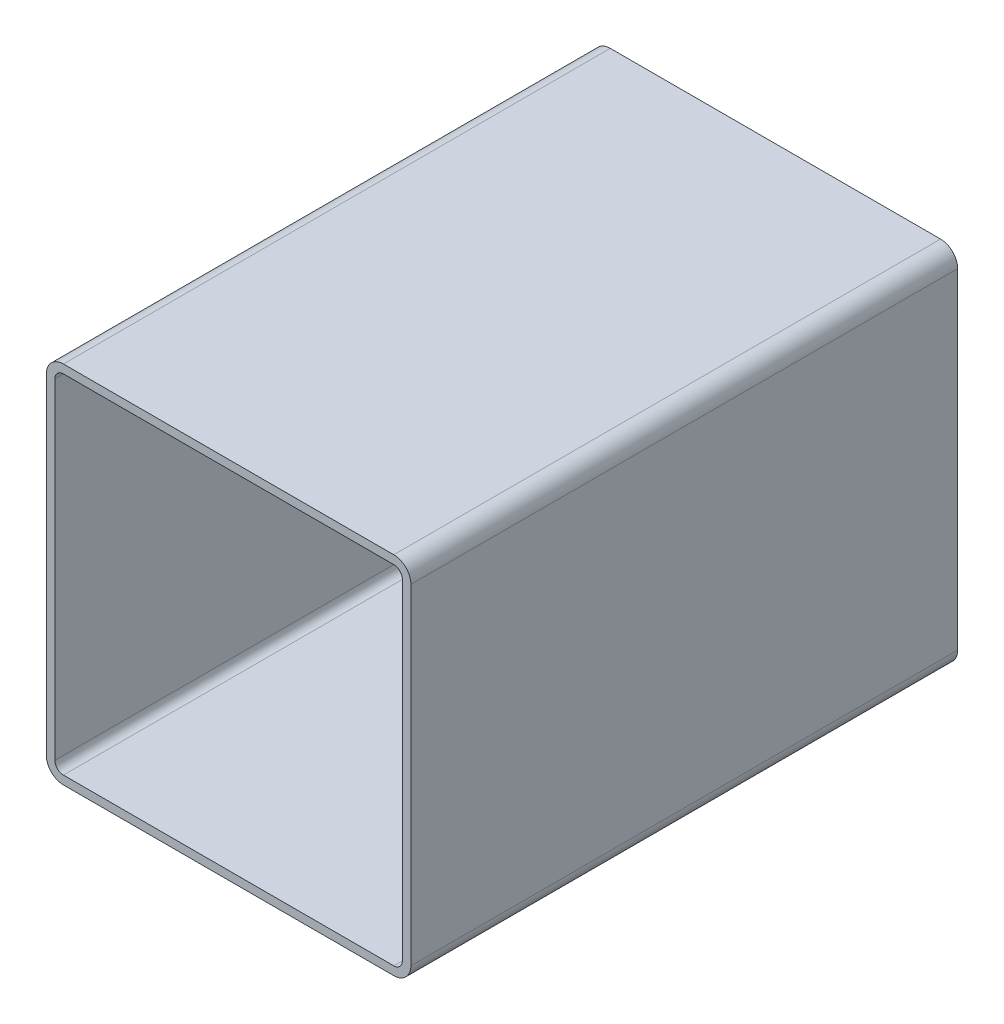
ISO-10303-21;
HEADER;
FILE_DESCRIPTION(('STEP AP214'),'2;1');
FILE_NAME('part.step','',(''),(''),'','','');
FILE_SCHEMA(('AUTOMOTIVE_DESIGN { 1 0 10303 214 1 1 1 1 }'));
ENDSEC;
DATA;
#1=APPLICATION_CONTEXT('core data for automotive mechanical design processes');
#2=APPLICATION_PROTOCOL_DEFINITION('international standard','automotive_design',2000,#1);
#3=PRODUCT_CONTEXT('',#1,'mechanical');
#4=PRODUCT('Part','Part','',(#3));
#5=PRODUCT_RELATED_PRODUCT_CATEGORY('part','',(#4));
#6=PRODUCT_DEFINITION_FORMATION('','',#4);
#7=PRODUCT_DEFINITION_CONTEXT('part definition',#1,'design');
#8=PRODUCT_DEFINITION('design','',#6,#7);
#9=PRODUCT_DEFINITION_SHAPE('','',#8);
#10=(LENGTH_UNIT() NAMED_UNIT(*) SI_UNIT(.MILLI.,.METRE.));
#11=(NAMED_UNIT(*) PLANE_ANGLE_UNIT() SI_UNIT($,.RADIAN.));
#12=(NAMED_UNIT(*) SI_UNIT($,.STERADIAN.) SOLID_ANGLE_UNIT());
#13=UNCERTAINTY_MEASURE_WITH_UNIT(LENGTH_MEASURE(1.E-05),#10,'distance_accuracy_value','');
#14=(GEOMETRIC_REPRESENTATION_CONTEXT(3) GLOBAL_UNCERTAINTY_ASSIGNED_CONTEXT((#13)) GLOBAL_UNIT_ASSIGNED_CONTEXT((#10,
#11,#12)) REPRESENTATION_CONTEXT('',''));
#15=CARTESIAN_POINT('',(0.,0.,0.));
#16=DIRECTION('',(0.,0.,1.));
#17=DIRECTION('',(1.,0.,0.));
#18=AXIS2_PLACEMENT_3D('',#15,#16,#17);
#19=CARTESIAN_POINT('',(10.9159404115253,195.641130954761,304.8));
#20=DIRECTION('',(0.,0.,1.));
#21=DIRECTION('',(1.,0.,0.));
#22=AXIS2_PLACEMENT_3D('',#19,#20,#21);
#23=PLANE('',#22);
#24=CARTESIAN_POINT('',(10.9159404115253,195.641130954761,304.8));
#25=DIRECTION('',(0.,0.,1.));
#26=DIRECTION('',(1.,0.,0.));
#27=AXIS2_PLACEMENT_3D('',#24,#25,#26);
#28=CIRCLE('',#27,9.52500000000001);
#29=CARTESIAN_POINT('',(10.9159404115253,205.166130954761,304.8));
#30=VERTEX_POINT('',#29);
#31=CARTESIAN_POINT('',(1.3909404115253,195.641130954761,304.8));
#32=VERTEX_POINT('',#31);
#33=EDGE_CURVE('E211',#30,#32,#28,.T.);
#34=ORIENTED_EDGE('',*,*,#33,.T.);
#35=DIRECTION('',(0.,-1.,0.));
#36=VECTOR('',#35,1.);
#37=CARTESIAN_POINT('',(1.3909404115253,11.4911309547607,304.8));
#38=LINE('',#37,#36);
#39=CARTESIAN_POINT('',(1.3909404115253,11.4911309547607,304.8));
#40=VERTEX_POINT('',#39);
#41=EDGE_CURVE('E214',#32,#40,#38,.T.);
#42=ORIENTED_EDGE('',*,*,#41,.T.);
#43=CARTESIAN_POINT('',(10.9159404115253,11.4911309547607,304.8));
#44=DIRECTION('',(0.,0.,1.));
#45=DIRECTION('',(1.,0.,0.));
#46=AXIS2_PLACEMENT_3D('',#43,#44,#45);
#47=CIRCLE('',#46,9.525);
#48=CARTESIAN_POINT('',(10.9159404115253,1.96613095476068,304.8));
#49=VERTEX_POINT('',#48);
#50=EDGE_CURVE('E217',#40,#49,#47,.T.);
#51=ORIENTED_EDGE('',*,*,#50,.T.);
#52=DIRECTION('',(1.,0.,0.));
#53=VECTOR('',#52,1.);
#54=CARTESIAN_POINT('',(195.065940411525,1.96613095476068,304.8));
#55=LINE('',#54,#53);
#56=CARTESIAN_POINT('',(195.065940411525,1.96613095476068,304.8));
#57=VERTEX_POINT('',#56);
#58=EDGE_CURVE('E219',#49,#57,#55,.T.);
#59=ORIENTED_EDGE('',*,*,#58,.T.);
#60=CARTESIAN_POINT('',(195.065940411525,11.4911309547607,304.8));
#61=DIRECTION('',(0.,0.,1.));
#62=DIRECTION('',(1.,0.,0.));
#63=AXIS2_PLACEMENT_3D('',#60,#61,#62);
#64=CIRCLE('',#63,9.525);
#65=CARTESIAN_POINT('',(204.590940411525,11.4911309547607,304.8));
#66=VERTEX_POINT('',#65);
#67=EDGE_CURVE('E221',#57,#66,#64,.T.);
#68=ORIENTED_EDGE('',*,*,#67,.T.);
#69=DIRECTION('',(0.,1.,0.));
#70=VECTOR('',#69,1.);
#71=CARTESIAN_POINT('',(204.590940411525,195.641130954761,304.8));
#72=LINE('',#71,#70);
#73=CARTESIAN_POINT('',(204.590940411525,195.641130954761,304.8));
#74=VERTEX_POINT('',#73);
#75=EDGE_CURVE('E223',#66,#74,#72,.T.);
#76=ORIENTED_EDGE('',*,*,#75,.T.);
#77=CARTESIAN_POINT('',(195.065940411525,195.641130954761,304.8));
#78=DIRECTION('',(0.,0.,1.));
#79=DIRECTION('',(1.,0.,0.));
#80=AXIS2_PLACEMENT_3D('',#77,#78,#79);
#81=CIRCLE('',#80,9.52500000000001);
#82=CARTESIAN_POINT('',(195.065940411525,205.166130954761,304.8));
#83=VERTEX_POINT('',#82);
#84=EDGE_CURVE('E225',#74,#83,#81,.T.);
#85=ORIENTED_EDGE('',*,*,#84,.T.);
#86=DIRECTION('',(-1.,0.,0.));
#87=VECTOR('',#86,1.);
#88=CARTESIAN_POINT('',(10.9159404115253,205.166130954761,304.8));
#89=LINE('',#88,#87);
#90=EDGE_CURVE('E227',#83,#30,#89,.T.);
#91=ORIENTED_EDGE('',*,*,#90,.T.);
#92=EDGE_LOOP('',(#34,#42,#51,#59,#68,#76,#85,#91));
#93=FACE_BOUND('',#92,.T.);
#94=DIRECTION('',(0.,-1.,0.));
#95=VECTOR('',#94,1.);
#96=CARTESIAN_POINT('',(6.1534404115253,11.4911309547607,304.8));
#97=LINE('',#96,#95);
#98=CARTESIAN_POINT('',(6.1534404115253,195.641130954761,304.8));
#99=VERTEX_POINT('',#98);
#100=CARTESIAN_POINT('',(6.1534404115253,11.4911309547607,304.8));
#101=VERTEX_POINT('',#100);
#102=EDGE_CURVE('E154',#99,#101,#97,.T.);
#103=ORIENTED_EDGE('',*,*,#102,.F.);
#104=CARTESIAN_POINT('',(10.9159404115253,195.641130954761,304.8));
#105=DIRECTION('',(0.,0.,1.));
#106=DIRECTION('',(1.,0.,0.));
#107=AXIS2_PLACEMENT_3D('',#104,#105,#106);
#108=CIRCLE('',#107,4.7625);
#109=CARTESIAN_POINT('',(10.9159404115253,200.403630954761,304.8));
#110=VERTEX_POINT('',#109);
#111=EDGE_CURVE('E146',#110,#99,#108,.T.);
#112=ORIENTED_EDGE('',*,*,#111,.F.);
#113=DIRECTION('',(-1.,0.,0.));
#114=VECTOR('',#113,1.);
#115=CARTESIAN_POINT('',(10.9159404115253,200.403630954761,304.8));
#116=LINE('',#115,#114);
#117=CARTESIAN_POINT('',(195.065940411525,200.403630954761,304.8));
#118=VERTEX_POINT('',#117);
#119=EDGE_CURVE('E179',#118,#110,#116,.T.);
#120=ORIENTED_EDGE('',*,*,#119,.F.);
#121=CARTESIAN_POINT('',(195.065940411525,195.641130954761,304.8));
#122=DIRECTION('',(0.,0.,1.));
#123=DIRECTION('',(1.,0.,0.));
#124=AXIS2_PLACEMENT_3D('',#121,#122,#123);
#125=CIRCLE('',#124,4.7625);
#126=CARTESIAN_POINT('',(199.828440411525,195.641130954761,304.8));
#127=VERTEX_POINT('',#126);
#128=EDGE_CURVE('E177',#127,#118,#125,.T.);
#129=ORIENTED_EDGE('',*,*,#128,.F.);
#130=DIRECTION('',(0.,1.,0.));
#131=VECTOR('',#130,1.);
#132=CARTESIAN_POINT('',(199.828440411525,195.641130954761,304.8));
#133=LINE('',#132,#131);
#134=CARTESIAN_POINT('',(199.828440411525,11.4911309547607,304.8));
#135=VERTEX_POINT('',#134);
#136=EDGE_CURVE('E175',#135,#127,#133,.T.);
#137=ORIENTED_EDGE('',*,*,#136,.F.);
#138=CARTESIAN_POINT('',(195.065940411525,11.4911309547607,304.8));
#139=DIRECTION('',(0.,0.,1.));
#140=DIRECTION('',(1.,0.,0.));
#141=AXIS2_PLACEMENT_3D('',#138,#139,#140);
#142=CIRCLE('',#141,4.7625);
#143=CARTESIAN_POINT('',(195.065940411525,6.72863095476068,304.8));
#144=VERTEX_POINT('',#143);
#145=EDGE_CURVE('E173',#144,#135,#142,.T.);
#146=ORIENTED_EDGE('',*,*,#145,.F.);
#147=DIRECTION('',(1.,0.,0.));
#148=VECTOR('',#147,1.);
#149=CARTESIAN_POINT('',(195.065940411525,6.72863095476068,304.8));
#150=LINE('',#149,#148);
#151=CARTESIAN_POINT('',(10.9159404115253,6.72863095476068,304.8));
#152=VERTEX_POINT('',#151);
#153=EDGE_CURVE('E169',#152,#144,#150,.T.);
#154=ORIENTED_EDGE('',*,*,#153,.F.);
#155=CARTESIAN_POINT('',(10.9159404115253,11.4911309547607,304.8));
#156=DIRECTION('',(0.,0.,1.));
#157=DIRECTION('',(1.,0.,0.));
#158=AXIS2_PLACEMENT_3D('',#155,#156,#157);
#159=CIRCLE('',#158,4.7625);
#160=EDGE_CURVE('E167',#101,#152,#159,.T.);
#161=ORIENTED_EDGE('',*,*,#160,.F.);
#162=EDGE_LOOP('',(#103,#112,#120,#129,#137,#146,#154,#161));
#163=FACE_BOUND('',#162,.T.);
#164=ADVANCED_FACE('F33',(#93,#163),#23,.T.);
#165=CARTESIAN_POINT('',(10.9159404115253,195.641130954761,0.));
#166=DIRECTION('',(0.,0.,1.));
#167=DIRECTION('',(1.,0.,0.));
#168=AXIS2_PLACEMENT_3D('',#165,#166,#167);
#169=PLANE('',#168);
#170=CARTESIAN_POINT('',(10.9159404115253,195.641130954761,0.));
#171=DIRECTION('',(0.,0.,1.));
#172=DIRECTION('',(1.,0.,0.));
#173=AXIS2_PLACEMENT_3D('',#170,#171,#172);
#174=CIRCLE('',#173,9.52500000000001);
#175=CARTESIAN_POINT('',(10.9159404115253,205.166130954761,0.));
#176=VERTEX_POINT('',#175);
#177=CARTESIAN_POINT('',(1.3909404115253,195.641130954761,0.));
#178=VERTEX_POINT('',#177);
#179=EDGE_CURVE('E162',#176,#178,#174,.T.);
#180=ORIENTED_EDGE('',*,*,#179,.F.);
#181=DIRECTION('',(-1.,0.,0.));
#182=VECTOR('',#181,1.);
#183=CARTESIAN_POINT('',(10.9159404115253,205.166130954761,0.));
#184=LINE('',#183,#182);
#185=CARTESIAN_POINT('',(195.065940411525,205.166130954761,0.));
#186=VERTEX_POINT('',#185);
#187=EDGE_CURVE('E215',#186,#176,#184,.T.);
#188=ORIENTED_EDGE('',*,*,#187,.F.);
#189=CARTESIAN_POINT('',(195.065940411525,195.641130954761,0.));
#190=DIRECTION('',(0.,0.,1.));
#191=DIRECTION('',(1.,0.,0.));
#192=AXIS2_PLACEMENT_3D('',#189,#190,#191);
#193=CIRCLE('',#192,9.52500000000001);
#194=CARTESIAN_POINT('',(204.590940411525,195.641130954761,0.));
#195=VERTEX_POINT('',#194);
#196=EDGE_CURVE('E242',#195,#186,#193,.T.);
#197=ORIENTED_EDGE('',*,*,#196,.F.);
#198=DIRECTION('',(0.,1.,0.));
#199=VECTOR('',#198,1.);
#200=CARTESIAN_POINT('',(204.590940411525,195.641130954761,0.));
#201=LINE('',#200,#199);
#202=CARTESIAN_POINT('',(204.590940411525,11.4911309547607,0.));
#203=VERTEX_POINT('',#202);
#204=EDGE_CURVE('E240',#203,#195,#201,.T.);
#205=ORIENTED_EDGE('',*,*,#204,.F.);
#206=CARTESIAN_POINT('',(195.065940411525,11.4911309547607,0.));
#207=DIRECTION('',(0.,0.,1.));
#208=DIRECTION('',(1.,0.,0.));
#209=AXIS2_PLACEMENT_3D('',#206,#207,#208);
#210=CIRCLE('',#209,9.525);
#211=CARTESIAN_POINT('',(195.065940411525,1.96613095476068,0.));
#212=VERTEX_POINT('',#211);
#213=EDGE_CURVE('E238',#212,#203,#210,.T.);
#214=ORIENTED_EDGE('',*,*,#213,.F.);
#215=DIRECTION('',(1.,0.,0.));
#216=VECTOR('',#215,1.);
#217=CARTESIAN_POINT('',(195.065940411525,1.96613095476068,0.));
#218=LINE('',#217,#216);
#219=CARTESIAN_POINT('',(10.9159404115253,1.96613095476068,0.));
#220=VERTEX_POINT('',#219);
#221=EDGE_CURVE('E236',#220,#212,#218,.T.);
#222=ORIENTED_EDGE('',*,*,#221,.F.);
#223=CARTESIAN_POINT('',(10.9159404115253,11.4911309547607,0.));
#224=DIRECTION('',(0.,0.,1.));
#225=DIRECTION('',(1.,0.,0.));
#226=AXIS2_PLACEMENT_3D('',#223,#224,#225);
#227=CIRCLE('',#226,9.525);
#228=CARTESIAN_POINT('',(1.3909404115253,11.4911309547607,0.));
#229=VERTEX_POINT('',#228);
#230=EDGE_CURVE('E234',#229,#220,#227,.T.);
#231=ORIENTED_EDGE('',*,*,#230,.F.);
#232=DIRECTION('',(0.,-1.,0.));
#233=VECTOR('',#232,1.);
#234=CARTESIAN_POINT('',(1.3909404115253,11.4911309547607,0.));
#235=LINE('',#234,#233);
#236=EDGE_CURVE('E232',#178,#229,#235,.T.);
#237=ORIENTED_EDGE('',*,*,#236,.F.);
#238=EDGE_LOOP('',(#180,#188,#197,#205,#214,#222,#231,#237));
#239=FACE_BOUND('',#238,.T.);
#240=CARTESIAN_POINT('',(10.9159404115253,195.641130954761,0.));
#241=DIRECTION('',(0.,0.,1.));
#242=DIRECTION('',(1.,0.,0.));
#243=AXIS2_PLACEMENT_3D('',#240,#241,#242);
#244=CIRCLE('',#243,4.7625);
#245=CARTESIAN_POINT('',(10.9159404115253,200.403630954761,0.));
#246=VERTEX_POINT('',#245);
#247=CARTESIAN_POINT('',(6.1534404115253,195.641130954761,0.));
#248=VERTEX_POINT('',#247);
#249=EDGE_CURVE('E56',#246,#248,#244,.T.);
#250=ORIENTED_EDGE('',*,*,#249,.T.);
#251=DIRECTION('',(0.,-1.,0.));
#252=VECTOR('',#251,1.);
#253=CARTESIAN_POINT('',(6.1534404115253,11.4911309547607,0.));
#254=LINE('',#253,#252);
#255=CARTESIAN_POINT('',(6.1534404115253,11.4911309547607,0.));
#256=VERTEX_POINT('',#255);
#257=EDGE_CURVE('E161',#248,#256,#254,.T.);
#258=ORIENTED_EDGE('',*,*,#257,.T.);
#259=CARTESIAN_POINT('',(10.9159404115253,11.4911309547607,0.));
#260=DIRECTION('',(0.,0.,1.));
#261=DIRECTION('',(1.,0.,0.));
#262=AXIS2_PLACEMENT_3D('',#259,#260,#261);
#263=CIRCLE('',#262,4.7625);
#264=CARTESIAN_POINT('',(10.9159404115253,6.72863095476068,0.));
#265=VERTEX_POINT('',#264);
#266=EDGE_CURVE('E183',#256,#265,#263,.T.);
#267=ORIENTED_EDGE('',*,*,#266,.T.);
#268=DIRECTION('',(1.,0.,0.));
#269=VECTOR('',#268,1.);
#270=CARTESIAN_POINT('',(195.065940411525,6.72863095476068,0.));
#271=LINE('',#270,#269);
#272=CARTESIAN_POINT('',(195.065940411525,6.72863095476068,0.));
#273=VERTEX_POINT('',#272);
#274=EDGE_CURVE('E186',#265,#273,#271,.T.);
#275=ORIENTED_EDGE('',*,*,#274,.T.);
#276=CARTESIAN_POINT('',(195.065940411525,11.4911309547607,0.));
#277=DIRECTION('',(0.,0.,1.));
#278=DIRECTION('',(1.,0.,0.));
#279=AXIS2_PLACEMENT_3D('',#276,#277,#278);
#280=CIRCLE('',#279,4.7625);
#281=CARTESIAN_POINT('',(199.828440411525,11.4911309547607,0.));
#282=VERTEX_POINT('',#281);
#283=EDGE_CURVE('E189',#273,#282,#280,.T.);
#284=ORIENTED_EDGE('',*,*,#283,.T.);
#285=DIRECTION('',(0.,1.,0.));
#286=VECTOR('',#285,1.);
#287=CARTESIAN_POINT('',(199.828440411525,195.641130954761,0.));
#288=LINE('',#287,#286);
#289=CARTESIAN_POINT('',(199.828440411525,195.641130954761,0.));
#290=VERTEX_POINT('',#289);
#291=EDGE_CURVE('E192',#282,#290,#288,.T.);
#292=ORIENTED_EDGE('',*,*,#291,.T.);
#293=CARTESIAN_POINT('',(195.065940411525,195.641130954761,0.));
#294=DIRECTION('',(0.,0.,1.));
#295=DIRECTION('',(1.,0.,0.));
#296=AXIS2_PLACEMENT_3D('',#293,#294,#295);
#297=CIRCLE('',#296,4.7625);
#298=CARTESIAN_POINT('',(195.065940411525,200.403630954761,0.));
#299=VERTEX_POINT('',#298);
#300=EDGE_CURVE('E195',#290,#299,#297,.T.);
#301=ORIENTED_EDGE('',*,*,#300,.T.);
#302=DIRECTION('',(-1.,0.,0.));
#303=VECTOR('',#302,1.);
#304=CARTESIAN_POINT('',(10.9159404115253,200.403630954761,0.));
#305=LINE('',#304,#303);
#306=EDGE_CURVE('E155',#299,#246,#305,.T.);
#307=ORIENTED_EDGE('',*,*,#306,.T.);
#308=EDGE_LOOP('',(#250,#258,#267,#275,#284,#292,#301,#307));
#309=FACE_BOUND('',#308,.T.);
#310=ADVANCED_FACE('F272',(#239,#309),#169,.F.);
#311=CARTESIAN_POINT('',(10.9159404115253,195.641130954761,304.8));
#312=DIRECTION('',(0.,0.,-1.));
#313=DIRECTION('',(-1.,0.,0.));
#314=AXIS2_PLACEMENT_3D('',#311,#312,#313);
#315=CYLINDRICAL_SURFACE('',#314,9.52500000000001);
#316=ORIENTED_EDGE('',*,*,#179,.T.);
#317=DIRECTION('',(0.,0.,-1.));
#318=VECTOR('',#317,1.);
#319=CARTESIAN_POINT('',(1.3909404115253,195.641130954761,304.8));
#320=LINE('',#319,#318);
#321=EDGE_CURVE('E11',#32,#178,#320,.T.);
#322=ORIENTED_EDGE('',*,*,#321,.F.);
#323=ORIENTED_EDGE('',*,*,#33,.F.);
#324=DIRECTION('',(0.,0.,-1.));
#325=VECTOR('',#324,1.);
#326=CARTESIAN_POINT('',(10.9159404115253,205.166130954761,304.8));
#327=LINE('',#326,#325);
#328=EDGE_CURVE('E229',#30,#176,#327,.T.);
#329=ORIENTED_EDGE('',*,*,#328,.T.);
#330=EDGE_LOOP('',(#316,#322,#323,#329));
#331=FACE_BOUND('',#330,.T.);
#332=ADVANCED_FACE('F35',(#331),#315,.T.);
#333=CARTESIAN_POINT('',(1.3909404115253,11.4911309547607,304.8));
#334=DIRECTION('',(1.,0.,0.));
#335=DIRECTION('',(0.,0.,-1.));
#336=AXIS2_PLACEMENT_3D('',#333,#334,#335);
#337=PLANE('',#336);
#338=ORIENTED_EDGE('',*,*,#236,.T.);
#339=DIRECTION('',(0.,0.,-1.));
#340=VECTOR('',#339,1.);
#341=CARTESIAN_POINT('',(1.3909404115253,11.4911309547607,304.8));
#342=LINE('',#341,#340);
#343=EDGE_CURVE('E41',#40,#229,#342,.T.);
#344=ORIENTED_EDGE('',*,*,#343,.F.);
#345=ORIENTED_EDGE('',*,*,#41,.F.);
#346=ORIENTED_EDGE('',*,*,#321,.T.);
#347=EDGE_LOOP('',(#338,#344,#345,#346));
#348=FACE_BOUND('',#347,.T.);
#349=ADVANCED_FACE('F289',(#348),#337,.F.);
#350=CARTESIAN_POINT('',(10.9159404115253,11.4911309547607,304.8));
#351=DIRECTION('',(0.,0.,-1.));
#352=DIRECTION('',(-1.,0.,0.));
#353=AXIS2_PLACEMENT_3D('',#350,#351,#352);
#354=CYLINDRICAL_SURFACE('',#353,9.525);
#355=ORIENTED_EDGE('',*,*,#230,.T.);
#356=DIRECTION('',(0.,0.,-1.));
#357=VECTOR('',#356,1.);
#358=CARTESIAN_POINT('',(10.9159404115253,1.96613095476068,304.8));
#359=LINE('',#358,#357);
#360=EDGE_CURVE('E259',#49,#220,#359,.T.);
#361=ORIENTED_EDGE('',*,*,#360,.F.);
#362=ORIENTED_EDGE('',*,*,#50,.F.);
#363=ORIENTED_EDGE('',*,*,#343,.T.);
#364=EDGE_LOOP('',(#355,#361,#362,#363));
#365=FACE_BOUND('',#364,.T.);
#366=ADVANCED_FACE('F266',(#365),#354,.T.);
#367=CARTESIAN_POINT('',(195.065940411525,1.96613095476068,304.8));
#368=DIRECTION('',(0.,1.,0.));
#369=DIRECTION('',(0.,0.,1.));
#370=AXIS2_PLACEMENT_3D('',#367,#368,#369);
#371=PLANE('',#370);
#372=ORIENTED_EDGE('',*,*,#221,.T.);
#373=DIRECTION('',(0.,0.,-1.));
#374=VECTOR('',#373,1.);
#375=CARTESIAN_POINT('',(195.065940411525,1.96613095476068,304.8));
#376=LINE('',#375,#374);
#377=EDGE_CURVE('E256',#57,#212,#376,.T.);
#378=ORIENTED_EDGE('',*,*,#377,.F.);
#379=ORIENTED_EDGE('',*,*,#58,.F.);
#380=ORIENTED_EDGE('',*,*,#360,.T.);
#381=EDGE_LOOP('',(#372,#378,#379,#380));
#382=FACE_BOUND('',#381,.T.);
#383=ADVANCED_FACE('F278',(#382),#371,.F.);
#384=CARTESIAN_POINT('',(195.065940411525,11.4911309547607,304.8));
#385=DIRECTION('',(0.,0.,-1.));
#386=DIRECTION('',(-1.,0.,0.));
#387=AXIS2_PLACEMENT_3D('',#384,#385,#386);
#388=CYLINDRICAL_SURFACE('',#387,9.525);
#389=ORIENTED_EDGE('',*,*,#213,.T.);
#390=DIRECTION('',(0.,0.,-1.));
#391=VECTOR('',#390,1.);
#392=CARTESIAN_POINT('',(204.590940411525,11.4911309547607,304.8));
#393=LINE('',#392,#391);
#394=EDGE_CURVE('E253',#66,#203,#393,.T.);
#395=ORIENTED_EDGE('',*,*,#394,.F.);
#396=ORIENTED_EDGE('',*,*,#67,.F.);
#397=ORIENTED_EDGE('',*,*,#377,.T.);
#398=EDGE_LOOP('',(#389,#395,#396,#397));
#399=FACE_BOUND('',#398,.T.);
#400=ADVANCED_FACE('F282',(#399),#388,.T.);
#401=CARTESIAN_POINT('',(204.590940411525,195.641130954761,304.8));
#402=DIRECTION('',(-1.,0.,0.));
#403=DIRECTION('',(0.,0.,1.));
#404=AXIS2_PLACEMENT_3D('',#401,#402,#403);
#405=PLANE('',#404);
#406=ORIENTED_EDGE('',*,*,#204,.T.);
#407=DIRECTION('',(0.,0.,-1.));
#408=VECTOR('',#407,1.);
#409=CARTESIAN_POINT('',(204.590940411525,195.641130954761,304.8));
#410=LINE('',#409,#408);
#411=EDGE_CURVE('E250',#74,#195,#410,.T.);
#412=ORIENTED_EDGE('',*,*,#411,.F.);
#413=ORIENTED_EDGE('',*,*,#75,.F.);
#414=ORIENTED_EDGE('',*,*,#394,.T.);
#415=EDGE_LOOP('',(#406,#412,#413,#414));
#416=FACE_BOUND('',#415,.T.);
#417=ADVANCED_FACE('F302',(#416),#405,.F.);
#418=CARTESIAN_POINT('',(195.065940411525,195.641130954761,304.8));
#419=DIRECTION('',(0.,0.,-1.));
#420=DIRECTION('',(-1.,0.,0.));
#421=AXIS2_PLACEMENT_3D('',#418,#419,#420);
#422=CYLINDRICAL_SURFACE('',#421,9.52500000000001);
#423=ORIENTED_EDGE('',*,*,#196,.T.);
#424=DIRECTION('',(0.,0.,-1.));
#425=VECTOR('',#424,1.);
#426=CARTESIAN_POINT('',(195.065940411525,205.166130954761,304.8));
#427=LINE('',#426,#425);
#428=EDGE_CURVE('E247',#83,#186,#427,.T.);
#429=ORIENTED_EDGE('',*,*,#428,.F.);
#430=ORIENTED_EDGE('',*,*,#84,.F.);
#431=ORIENTED_EDGE('',*,*,#411,.T.);
#432=EDGE_LOOP('',(#423,#429,#430,#431));
#433=FACE_BOUND('',#432,.T.);
#434=ADVANCED_FACE('F300',(#433),#422,.T.);
#435=CARTESIAN_POINT('',(10.9159404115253,205.166130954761,304.8));
#436=DIRECTION('',(0.,-1.,0.));
#437=DIRECTION('',(0.,0.,-1.));
#438=AXIS2_PLACEMENT_3D('',#435,#436,#437);
#439=PLANE('',#438);
#440=ORIENTED_EDGE('',*,*,#187,.T.);
#441=ORIENTED_EDGE('',*,*,#328,.F.);
#442=ORIENTED_EDGE('',*,*,#90,.F.);
#443=ORIENTED_EDGE('',*,*,#428,.T.);
#444=EDGE_LOOP('',(#440,#441,#442,#443));
#445=FACE_BOUND('',#444,.T.);
#446=ADVANCED_FACE('F295',(#445),#439,.F.);
#447=CARTESIAN_POINT('',(10.9159404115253,195.641130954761,304.8));
#448=DIRECTION('',(0.,0.,-1.));
#449=DIRECTION('',(-1.,0.,0.));
#450=AXIS2_PLACEMENT_3D('',#447,#448,#449);
#451=CYLINDRICAL_SURFACE('',#450,4.7625);
#452=ORIENTED_EDGE('',*,*,#249,.F.);
#453=DIRECTION('',(0.,0.,-1.));
#454=VECTOR('',#453,1.);
#455=CARTESIAN_POINT('',(10.9159404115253,200.403630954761,304.8));
#456=LINE('',#455,#454);
#457=EDGE_CURVE('E150',#110,#246,#456,.T.);
#458=ORIENTED_EDGE('',*,*,#457,.F.);
#459=ORIENTED_EDGE('',*,*,#111,.T.);
#460=DIRECTION('',(0.,0.,-1.));
#461=VECTOR('',#460,1.);
#462=CARTESIAN_POINT('',(6.1534404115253,195.641130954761,304.8));
#463=LINE('',#462,#461);
#464=EDGE_CURVE('E149',#99,#248,#463,.T.);
#465=ORIENTED_EDGE('',*,*,#464,.T.);
#466=EDGE_LOOP('',(#452,#458,#459,#465));
#467=FACE_BOUND('',#466,.T.);
#468=ADVANCED_FACE('F148',(#467),#451,.F.);
#469=CARTESIAN_POINT('',(6.1534404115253,11.4911309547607,304.8));
#470=DIRECTION('',(1.,0.,0.));
#471=DIRECTION('',(0.,0.,-1.));
#472=AXIS2_PLACEMENT_3D('',#469,#470,#471);
#473=PLANE('',#472);
#474=ORIENTED_EDGE('',*,*,#257,.F.);
#475=ORIENTED_EDGE('',*,*,#464,.F.);
#476=ORIENTED_EDGE('',*,*,#102,.T.);
#477=DIRECTION('',(0.,0.,-1.));
#478=VECTOR('',#477,1.);
#479=CARTESIAN_POINT('',(6.1534404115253,11.4911309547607,304.8));
#480=LINE('',#479,#478);
#481=EDGE_CURVE('E163',#101,#256,#480,.T.);
#482=ORIENTED_EDGE('',*,*,#481,.T.);
#483=EDGE_LOOP('',(#474,#475,#476,#482));
#484=FACE_BOUND('',#483,.T.);
#485=ADVANCED_FACE('F158',(#484),#473,.T.);
#486=CARTESIAN_POINT('',(10.9159404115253,11.4911309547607,304.8));
#487=DIRECTION('',(0.,0.,-1.));
#488=DIRECTION('',(-1.,0.,0.));
#489=AXIS2_PLACEMENT_3D('',#486,#487,#488);
#490=CYLINDRICAL_SURFACE('',#489,4.7625);
#491=ORIENTED_EDGE('',*,*,#266,.F.);
#492=ORIENTED_EDGE('',*,*,#481,.F.);
#493=ORIENTED_EDGE('',*,*,#160,.T.);
#494=DIRECTION('',(0.,0.,-1.));
#495=VECTOR('',#494,1.);
#496=CARTESIAN_POINT('',(10.9159404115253,6.72863095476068,304.8));
#497=LINE('',#496,#495);
#498=EDGE_CURVE('E208',#152,#265,#497,.T.);
#499=ORIENTED_EDGE('',*,*,#498,.T.);
#500=EDGE_LOOP('',(#491,#492,#493,#499));
#501=FACE_BOUND('',#500,.T.);
#502=ADVANCED_FACE('F327',(#501),#490,.F.);
#503=CARTESIAN_POINT('',(195.065940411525,6.72863095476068,304.8));
#504=DIRECTION('',(0.,1.,0.));
#505=DIRECTION('',(0.,0.,1.));
#506=AXIS2_PLACEMENT_3D('',#503,#504,#505);
#507=PLANE('',#506);
#508=ORIENTED_EDGE('',*,*,#274,.F.);
#509=ORIENTED_EDGE('',*,*,#498,.F.);
#510=ORIENTED_EDGE('',*,*,#153,.T.);
#511=DIRECTION('',(0.,0.,-1.));
#512=VECTOR('',#511,1.);
#513=CARTESIAN_POINT('',(195.065940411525,6.72863095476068,304.8));
#514=LINE('',#513,#512);
#515=EDGE_CURVE('E206',#144,#273,#514,.T.);
#516=ORIENTED_EDGE('',*,*,#515,.T.);
#517=EDGE_LOOP('',(#508,#509,#510,#516));
#518=FACE_BOUND('',#517,.T.);
#519=ADVANCED_FACE('F331',(#518),#507,.T.);
#520=CARTESIAN_POINT('',(195.065940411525,11.4911309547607,304.8));
#521=DIRECTION('',(0.,0.,-1.));
#522=DIRECTION('',(-1.,0.,0.));
#523=AXIS2_PLACEMENT_3D('',#520,#521,#522);
#524=CYLINDRICAL_SURFACE('',#523,4.7625);
#525=ORIENTED_EDGE('',*,*,#283,.F.);
#526=ORIENTED_EDGE('',*,*,#515,.F.);
#527=ORIENTED_EDGE('',*,*,#145,.T.);
#528=DIRECTION('',(0.,0.,-1.));
#529=VECTOR('',#528,1.);
#530=CARTESIAN_POINT('',(199.828440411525,11.4911309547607,304.8));
#531=LINE('',#530,#529);
#532=EDGE_CURVE('E204',#135,#282,#531,.T.);
#533=ORIENTED_EDGE('',*,*,#532,.T.);
#534=EDGE_LOOP('',(#525,#526,#527,#533));
#535=FACE_BOUND('',#534,.T.);
#536=ADVANCED_FACE('F337',(#535),#524,.F.);
#537=CARTESIAN_POINT('',(199.828440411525,195.641130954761,304.8));
#538=DIRECTION('',(-1.,0.,0.));
#539=DIRECTION('',(0.,0.,1.));
#540=AXIS2_PLACEMENT_3D('',#537,#538,#539);
#541=PLANE('',#540);
#542=ORIENTED_EDGE('',*,*,#291,.F.);
#543=ORIENTED_EDGE('',*,*,#532,.F.);
#544=ORIENTED_EDGE('',*,*,#136,.T.);
#545=DIRECTION('',(0.,0.,-1.));
#546=VECTOR('',#545,1.);
#547=CARTESIAN_POINT('',(199.828440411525,195.641130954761,304.8));
#548=LINE('',#547,#546);
#549=EDGE_CURVE('E202',#127,#290,#548,.T.);
#550=ORIENTED_EDGE('',*,*,#549,.T.);
#551=EDGE_LOOP('',(#542,#543,#544,#550));
#552=FACE_BOUND('',#551,.T.);
#553=ADVANCED_FACE('F341',(#552),#541,.T.);
#554=CARTESIAN_POINT('',(195.065940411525,195.641130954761,304.8));
#555=DIRECTION('',(0.,0.,-1.));
#556=DIRECTION('',(-1.,0.,0.));
#557=AXIS2_PLACEMENT_3D('',#554,#555,#556);
#558=CYLINDRICAL_SURFACE('',#557,4.7625);
#559=ORIENTED_EDGE('',*,*,#300,.F.);
#560=ORIENTED_EDGE('',*,*,#549,.F.);
#561=ORIENTED_EDGE('',*,*,#128,.T.);
#562=DIRECTION('',(0.,0.,-1.));
#563=VECTOR('',#562,1.);
#564=CARTESIAN_POINT('',(195.065940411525,200.403630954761,304.8));
#565=LINE('',#564,#563);
#566=EDGE_CURVE('E48',#118,#299,#565,.T.);
#567=ORIENTED_EDGE('',*,*,#566,.T.);
#568=EDGE_LOOP('',(#559,#560,#561,#567));
#569=FACE_BOUND('',#568,.T.);
#570=ADVANCED_FACE('F345',(#569),#558,.F.);
#571=CARTESIAN_POINT('',(10.9159404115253,200.403630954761,304.8));
#572=DIRECTION('',(0.,-1.,0.));
#573=DIRECTION('',(0.,0.,-1.));
#574=AXIS2_PLACEMENT_3D('',#571,#572,#573);
#575=PLANE('',#574);
#576=ORIENTED_EDGE('',*,*,#306,.F.);
#577=ORIENTED_EDGE('',*,*,#566,.F.);
#578=ORIENTED_EDGE('',*,*,#119,.T.);
#579=ORIENTED_EDGE('',*,*,#457,.T.);
#580=EDGE_LOOP('',(#576,#577,#578,#579));
#581=FACE_BOUND('',#580,.T.);
#582=ADVANCED_FACE('F349',(#581),#575,.T.);
#583=CLOSED_SHELL('',(#164,#310,#332,#349,#366,#383,#400,#417,#434,#446,#468,#485,#502,#519,
#536,#553,#570,#582));
#584=MANIFOLD_SOLID_BREP('B2',#583);
#585=ADVANCED_BREP_SHAPE_REPRESENTATION('',(#18,#584),#14);
#586=SHAPE_DEFINITION_REPRESENTATION(#9,#585);
ENDSEC;
END-ISO-10303-21;
